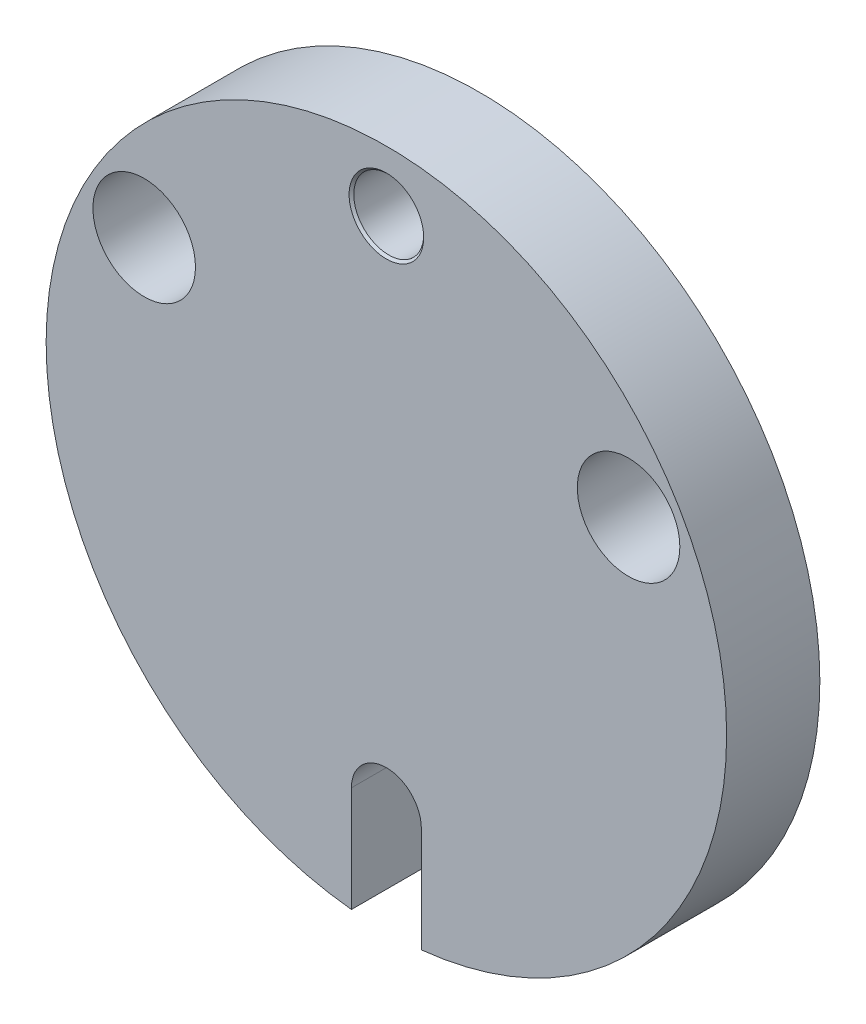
from build123d import *

# Parameters (mm, degrees)
SKETCH1_R          = 7.3
EXTRUDE1_DEPTH     = 2
SKETCH2_R          = 0.75
SKETCH2_R_2        = 1.1
CUT_EXTRUDE3_DEPTH = 2
CUT_EXTRUDE4_DEPTH = 11.515702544
SKETCH4_R          = 2.5
EXTRUDE2_DEPTH     = 0.5
EXTRUDE2_TAPER     = 20
CHAMFER1_SIZE      = 0.05


with BuildPart() as part:
    # Sketch1 → Extrude1 (new body)
    with BuildSketch(Plane.XY):
        Circle(SKETCH1_R)
    extrude(amount=EXTRUDE1_DEPTH)

    # Sketch2 → Cut-Extrude3 (cut)
    with BuildSketch(Plane.XY.offset(2)):
        with Locations((0, 6)):
            Circle(SKETCH2_R)
        with Locations((-5.196152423, 3)):
            Circle(SKETCH2_R_2)
        with Locations((5.196152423, 3)):
            Circle(SKETCH2_R_2)
    extrude(amount=-CUT_EXTRUDE3_DEPTH, mode=Mode.SUBTRACT)

    # Sketch3 → Cut-Extrude4 (cut, through all)
    with BuildSketch(Plane.XY.offset(2)):
        with BuildLine():
            Line((-0.75, -5), (-0.75, -11.269720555))
            Line((-0.75, -11.269720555), (0.75, -11.269720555))
            Line((0.75, -11.269720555), (0.75, -5))
            ThreePointArc((0.75, -5), (0, -4.25), (-0.75, -5))
        make_face()
    extrude(amount=-CUT_EXTRUDE4_DEPTH, mode=Mode.SUBTRACT)

    # Sketch4 → Extrude2 (add)
    with BuildSketch(Plane(origin=(0, 0, 0), x_dir=(-1, 0, 0), z_dir=(0, 0, -1))):
        Circle(SKETCH4_R)
    extrude(amount=EXTRUDE2_DEPTH, taper=EXTRUDE2_TAPER)

    # Cut-Extrude5 cone 1 section (on through the dimple's axis) → Cut-Extrude5 (revolve, cut)
    with BuildSketch(Plane(origin=(0, 0, -0.5), x_dir=(0, 1, 0), z_dir=(1, 0, 0))):
        Polygon((0, 0), (1.5, 0), (0, 1.5), align=None)
    revolve(axis=Axis((0, 0, -0.5), (0, 0, 1)), mode=Mode.SUBTRACT)

    # Chamfer1
    chamfer1_edges = [part.edges().sort_by_distance(p)[0] for p in [
        (-0.75, 6, 0),
        (-0.75, 6, 2),
    ]]
    chamfer(chamfer1_edges, length=CHAMFER1_SIZE)


solid = part.part
